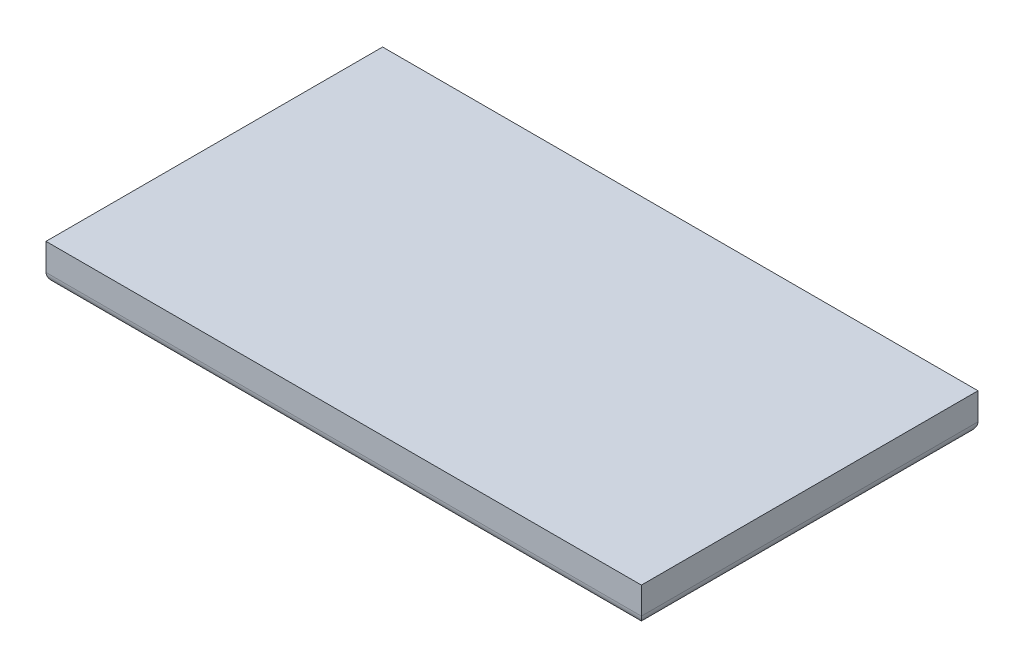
ISO-10303-21;
HEADER;
FILE_DESCRIPTION(('STEP AP214'),'2;1');
FILE_NAME('part.step','',(''),(''),'','','');
FILE_SCHEMA(('AUTOMOTIVE_DESIGN { 1 0 10303 214 1 1 1 1 }'));
ENDSEC;
DATA;
#1=APPLICATION_CONTEXT('core data for automotive mechanical design processes');
#2=APPLICATION_PROTOCOL_DEFINITION('international standard','automotive_design',2000,#1);
#3=PRODUCT_CONTEXT('',#1,'mechanical');
#4=PRODUCT('Part','Part','',(#3));
#5=PRODUCT_RELATED_PRODUCT_CATEGORY('part','',(#4));
#6=PRODUCT_DEFINITION_FORMATION('','',#4);
#7=PRODUCT_DEFINITION_CONTEXT('part definition',#1,'design');
#8=PRODUCT_DEFINITION('design','',#6,#7);
#9=PRODUCT_DEFINITION_SHAPE('','',#8);
#10=(LENGTH_UNIT() NAMED_UNIT(*) SI_UNIT(.MILLI.,.METRE.));
#11=(NAMED_UNIT(*) PLANE_ANGLE_UNIT() SI_UNIT($,.RADIAN.));
#12=(NAMED_UNIT(*) SI_UNIT($,.STERADIAN.) SOLID_ANGLE_UNIT());
#13=UNCERTAINTY_MEASURE_WITH_UNIT(LENGTH_MEASURE(1.E-05),#10,'distance_accuracy_value','');
#14=(GEOMETRIC_REPRESENTATION_CONTEXT(3) GLOBAL_UNCERTAINTY_ASSIGNED_CONTEXT((#13)) GLOBAL_UNIT_ASSIGNED_CONTEXT((#10,
#11,#12)) REPRESENTATION_CONTEXT('',''));
#15=CARTESIAN_POINT('',(0.,0.,0.));
#16=DIRECTION('',(0.,0.,1.));
#17=DIRECTION('',(1.,0.,0.));
#18=AXIS2_PLACEMENT_3D('',#15,#16,#17);
#19=CARTESIAN_POINT('',(8.844,1.1,-5.));
#20=DIRECTION('',(-1.,0.,0.));
#21=DIRECTION('',(0.,0.,1.));
#22=AXIS2_PLACEMENT_3D('',#19,#20,#21);
#23=PLANE('',#22);
#24=DIRECTION('',(0.,-1.,0.));
#25=VECTOR('',#24,1.);
#26=CARTESIAN_POINT('',(8.844,1.1,5.));
#27=LINE('',#26,#25);
#28=CARTESIAN_POINT('',(8.844,1.1,5.));
#29=VERTEX_POINT('',#28);
#30=CARTESIAN_POINT('',(8.844,0.3,5.));
#31=VERTEX_POINT('',#30);
#32=EDGE_CURVE('E153',#29,#31,#27,.T.);
#33=ORIENTED_EDGE('',*,*,#32,.T.);
#34=DIRECTION('',(0.,0.,-1.));
#35=VECTOR('',#34,1.);
#36=CARTESIAN_POINT('',(8.844,0.3,-5.));
#37=LINE('',#36,#35);
#38=CARTESIAN_POINT('',(8.844,0.3,-5.));
#39=VERTEX_POINT('',#38);
#40=EDGE_CURVE('E11',#31,#39,#37,.T.);
#41=ORIENTED_EDGE('',*,*,#40,.T.);
#42=DIRECTION('',(0.,-1.,0.));
#43=VECTOR('',#42,1.);
#44=CARTESIAN_POINT('',(8.844,1.1,-5.));
#45=LINE('',#44,#43);
#46=CARTESIAN_POINT('',(8.844,1.1,-5.));
#47=VERTEX_POINT('',#46);
#48=EDGE_CURVE('E95',#47,#39,#45,.T.);
#49=ORIENTED_EDGE('',*,*,#48,.F.);
#50=DIRECTION('',(0.,0.,-1.));
#51=VECTOR('',#50,1.);
#52=CARTESIAN_POINT('',(8.844,1.1,-5.));
#53=LINE('',#52,#51);
#54=EDGE_CURVE('E101',#29,#47,#53,.T.);
#55=ORIENTED_EDGE('',*,*,#54,.F.);
#56=EDGE_LOOP('',(#33,#41,#49,#55));
#57=FACE_BOUND('',#56,.T.);
#58=ADVANCED_FACE('F34',(#57),#23,.F.);
#59=CARTESIAN_POINT('',(-8.844,1.1,-5.));
#60=DIRECTION('',(0.,0.,1.));
#61=DIRECTION('',(1.,0.,0.));
#62=AXIS2_PLACEMENT_3D('',#59,#60,#61);
#63=PLANE('',#62);
#64=ORIENTED_EDGE('',*,*,#48,.T.);
#65=DIRECTION('',(-1.,0.,0.));
#66=VECTOR('',#65,1.);
#67=CARTESIAN_POINT('',(-8.844,0.3,-5.));
#68=LINE('',#67,#66);
#69=CARTESIAN_POINT('',(-8.844,0.3,-5.));
#70=VERTEX_POINT('',#69);
#71=EDGE_CURVE('E110',#39,#70,#68,.T.);
#72=ORIENTED_EDGE('',*,*,#71,.T.);
#73=DIRECTION('',(0.,-1.,0.));
#74=VECTOR('',#73,1.);
#75=CARTESIAN_POINT('',(-8.844,1.1,-5.));
#76=LINE('',#75,#74);
#77=CARTESIAN_POINT('',(-8.844,1.1,-5.));
#78=VERTEX_POINT('',#77);
#79=EDGE_CURVE('E97',#78,#70,#76,.T.);
#80=ORIENTED_EDGE('',*,*,#79,.F.);
#81=DIRECTION('',(-1.,0.,0.));
#82=VECTOR('',#81,1.);
#83=CARTESIAN_POINT('',(-8.844,1.1,-5.));
#84=LINE('',#83,#82);
#85=EDGE_CURVE('E90',#47,#78,#84,.T.);
#86=ORIENTED_EDGE('',*,*,#85,.F.);
#87=EDGE_LOOP('',(#64,#72,#80,#86));
#88=FACE_BOUND('',#87,.T.);
#89=ADVANCED_FACE('F92',(#88),#63,.F.);
#90=CARTESIAN_POINT('',(-8.844,1.1,-5.));
#91=DIRECTION('',(1.,0.,0.));
#92=DIRECTION('',(0.,0.,-1.));
#93=AXIS2_PLACEMENT_3D('',#90,#91,#92);
#94=PLANE('',#93);
#95=ORIENTED_EDGE('',*,*,#79,.T.);
#96=DIRECTION('',(0.,0.,1.));
#97=VECTOR('',#96,1.);
#98=CARTESIAN_POINT('',(-8.844,0.3,-5.));
#99=LINE('',#98,#97);
#100=CARTESIAN_POINT('',(-8.84399999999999,0.3,5.));
#101=VERTEX_POINT('',#100);
#102=EDGE_CURVE('E58',#70,#101,#99,.T.);
#103=ORIENTED_EDGE('',*,*,#102,.T.);
#104=DIRECTION('',(0.,-1.,0.));
#105=VECTOR('',#104,1.);
#106=CARTESIAN_POINT('',(-8.84399999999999,1.1,5.));
#107=LINE('',#106,#105);
#108=CARTESIAN_POINT('',(-8.84399999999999,1.1,5.));
#109=VERTEX_POINT('',#108);
#110=EDGE_CURVE('E114',#109,#101,#107,.T.);
#111=ORIENTED_EDGE('',*,*,#110,.F.);
#112=DIRECTION('',(0.,0.,1.));
#113=VECTOR('',#112,1.);
#114=CARTESIAN_POINT('',(-8.844,1.1,-5.));
#115=LINE('',#114,#113);
#116=EDGE_CURVE('E100',#78,#109,#115,.T.);
#117=ORIENTED_EDGE('',*,*,#116,.F.);
#118=EDGE_LOOP('',(#95,#103,#111,#117));
#119=FACE_BOUND('',#118,.T.);
#120=ADVANCED_FACE('F151',(#119),#94,.F.);
#121=CARTESIAN_POINT('',(-8.84399999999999,1.1,5.));
#122=DIRECTION('',(0.,0.,-1.));
#123=DIRECTION('',(-1.,0.,0.));
#124=AXIS2_PLACEMENT_3D('',#121,#122,#123);
#125=PLANE('',#124);
#126=ORIENTED_EDGE('',*,*,#110,.T.);
#127=DIRECTION('',(1.,0.,0.));
#128=VECTOR('',#127,1.);
#129=CARTESIAN_POINT('',(-8.84399999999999,0.3,5.));
#130=LINE('',#129,#128);
#131=EDGE_CURVE('E43',#101,#31,#130,.T.);
#132=ORIENTED_EDGE('',*,*,#131,.T.);
#133=ORIENTED_EDGE('',*,*,#32,.F.);
#134=DIRECTION('',(1.,0.,0.));
#135=VECTOR('',#134,1.);
#136=CARTESIAN_POINT('',(-8.84399999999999,1.1,5.));
#137=LINE('',#136,#135);
#138=EDGE_CURVE('E106',#109,#29,#137,.T.);
#139=ORIENTED_EDGE('',*,*,#138,.F.);
#140=EDGE_LOOP('',(#126,#132,#133,#139));
#141=FACE_BOUND('',#140,.T.);
#142=ADVANCED_FACE('F156',(#141),#125,.F.);
#143=CARTESIAN_POINT('',(0.,1.1,0.));
#144=DIRECTION('',(0.,1.,0.));
#145=DIRECTION('',(0.,0.,1.));
#146=AXIS2_PLACEMENT_3D('',#143,#144,#145);
#147=PLANE('',#146);
#148=ORIENTED_EDGE('',*,*,#54,.T.);
#149=ORIENTED_EDGE('',*,*,#85,.T.);
#150=ORIENTED_EDGE('',*,*,#116,.T.);
#151=ORIENTED_EDGE('',*,*,#138,.T.);
#152=EDGE_LOOP('',(#148,#149,#150,#151));
#153=FACE_BOUND('',#152,.T.);
#154=ADVANCED_FACE('F104',(#153),#147,.T.);
#155=CARTESIAN_POINT('',(0.,0.,0.));
#156=DIRECTION('',(0.,1.,0.));
#157=DIRECTION('',(0.,0.,1.));
#158=AXIS2_PLACEMENT_3D('',#155,#156,#157);
#159=PLANE('',#158);
#160=DIRECTION('',(0.,0.,1.));
#161=VECTOR('',#160,1.);
#162=CARTESIAN_POINT('',(-8.544,0.,0.));
#163=LINE('',#162,#161);
#164=CARTESIAN_POINT('',(-8.544,0.,4.7));
#165=VERTEX_POINT('',#164);
#166=CARTESIAN_POINT('',(-8.544,0.,-4.7));
#167=VERTEX_POINT('',#166);
#168=EDGE_CURVE('E121',#165,#167,#163,.F.);
#169=ORIENTED_EDGE('',*,*,#168,.T.);
#170=DIRECTION('',(-1.,0.,0.));
#171=VECTOR('',#170,1.);
#172=CARTESIAN_POINT('',(0.,0.,-4.7));
#173=LINE('',#172,#171);
#174=CARTESIAN_POINT('',(8.544,0.,-4.7));
#175=VERTEX_POINT('',#174);
#176=EDGE_CURVE('E123',#167,#175,#173,.F.);
#177=ORIENTED_EDGE('',*,*,#176,.T.);
#178=DIRECTION('',(0.,0.,-1.));
#179=VECTOR('',#178,1.);
#180=CARTESIAN_POINT('',(8.544,0.,0.));
#181=LINE('',#180,#179);
#182=CARTESIAN_POINT('',(8.544,0.,4.7));
#183=VERTEX_POINT('',#182);
#184=EDGE_CURVE('E112',#175,#183,#181,.F.);
#185=ORIENTED_EDGE('',*,*,#184,.T.);
#186=DIRECTION('',(1.,0.,0.));
#187=VECTOR('',#186,1.);
#188=CARTESIAN_POINT('',(0.,0.,4.7));
#189=LINE('',#188,#187);
#190=EDGE_CURVE('E119',#183,#165,#189,.F.);
#191=ORIENTED_EDGE('',*,*,#190,.T.);
#192=EDGE_LOOP('',(#169,#177,#185,#191));
#193=FACE_BOUND('',#192,.T.);
#194=ADVANCED_FACE('F144',(#193),#159,.F.);
#195=CARTESIAN_POINT('',(-8.84399999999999,0.3,4.7));
#196=DIRECTION('',(1.,0.,0.));
#197=DIRECTION('',(0.,0.,-1.));
#198=AXIS2_PLACEMENT_3D('',#195,#196,#197);
#199=CYLINDRICAL_SURFACE('',#198,0.3);
#200=CARTESIAN_POINT('',(-8.544,0.3,4.7));
#201=DIRECTION('',(0.707106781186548,0.,0.707106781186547));
#202=DIRECTION('',(0.707106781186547,0.,-0.707106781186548));
#203=AXIS2_PLACEMENT_3D('',#200,#201,#202);
#204=ELLIPSE('',#203,0.424264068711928,0.3);
#205=EDGE_CURVE('E131',#165,#101,#204,.F.);
#206=ORIENTED_EDGE('',*,*,#205,.F.);
#207=ORIENTED_EDGE('',*,*,#190,.F.);
#208=CARTESIAN_POINT('',(8.544,0.3,4.7));
#209=DIRECTION('',(0.707106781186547,0.,-0.707106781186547));
#210=DIRECTION('',(-0.707106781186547,0.,-0.707106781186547));
#211=AXIS2_PLACEMENT_3D('',#208,#209,#210);
#212=ELLIPSE('',#211,0.424264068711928,0.3);
#213=EDGE_CURVE('E38',#31,#183,#212,.T.);
#214=ORIENTED_EDGE('',*,*,#213,.F.);
#215=ORIENTED_EDGE('',*,*,#131,.F.);
#216=EDGE_LOOP('',(#206,#207,#214,#215));
#217=FACE_BOUND('',#216,.T.);
#218=ADVANCED_FACE('F36',(#217),#199,.T.);
#219=CARTESIAN_POINT('',(8.544,0.3,-5.));
#220=DIRECTION('',(0.,0.,-1.));
#221=DIRECTION('',(-1.,0.,0.));
#222=AXIS2_PLACEMENT_3D('',#219,#220,#221);
#223=CYLINDRICAL_SURFACE('',#222,0.3);
#224=ORIENTED_EDGE('',*,*,#213,.T.);
#225=ORIENTED_EDGE('',*,*,#184,.F.);
#226=CARTESIAN_POINT('',(8.544,0.3,-4.7));
#227=DIRECTION('',(-0.707106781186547,0.,-0.707106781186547));
#228=DIRECTION('',(0.707106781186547,0.,-0.707106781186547));
#229=AXIS2_PLACEMENT_3D('',#226,#227,#228);
#230=ELLIPSE('',#229,0.424264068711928,0.3);
#231=EDGE_CURVE('E130',#39,#175,#230,.T.);
#232=ORIENTED_EDGE('',*,*,#231,.F.);
#233=ORIENTED_EDGE('',*,*,#40,.F.);
#234=EDGE_LOOP('',(#224,#225,#232,#233));
#235=FACE_BOUND('',#234,.T.);
#236=ADVANCED_FACE('F140',(#235),#223,.T.);
#237=CARTESIAN_POINT('',(-8.544,0.3,-5.));
#238=DIRECTION('',(0.,0.,1.));
#239=DIRECTION('',(1.,0.,0.));
#240=AXIS2_PLACEMENT_3D('',#237,#238,#239);
#241=CYLINDRICAL_SURFACE('',#240,0.3);
#242=ORIENTED_EDGE('',*,*,#205,.T.);
#243=ORIENTED_EDGE('',*,*,#102,.F.);
#244=CARTESIAN_POINT('',(-8.544,0.3,-4.7));
#245=DIRECTION('',(-0.707106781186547,0.,0.707106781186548));
#246=DIRECTION('',(0.707106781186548,0.,0.707106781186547));
#247=AXIS2_PLACEMENT_3D('',#244,#245,#246);
#248=ELLIPSE('',#247,0.424264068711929,0.3);
#249=EDGE_CURVE('E128',#167,#70,#248,.F.);
#250=ORIENTED_EDGE('',*,*,#249,.F.);
#251=ORIENTED_EDGE('',*,*,#168,.F.);
#252=EDGE_LOOP('',(#242,#243,#250,#251));
#253=FACE_BOUND('',#252,.T.);
#254=ADVANCED_FACE('F150',(#253),#241,.T.);
#255=CARTESIAN_POINT('',(-8.844,0.3,-4.7));
#256=DIRECTION('',(-1.,0.,0.));
#257=DIRECTION('',(0.,0.,1.));
#258=AXIS2_PLACEMENT_3D('',#255,#256,#257);
#259=CYLINDRICAL_SURFACE('',#258,0.3);
#260=ORIENTED_EDGE('',*,*,#231,.T.);
#261=ORIENTED_EDGE('',*,*,#176,.F.);
#262=ORIENTED_EDGE('',*,*,#249,.T.);
#263=ORIENTED_EDGE('',*,*,#71,.F.);
#264=EDGE_LOOP('',(#260,#261,#262,#263));
#265=FACE_BOUND('',#264,.T.);
#266=ADVANCED_FACE('F148',(#265),#259,.T.);
#267=CLOSED_SHELL('',(#58,#89,#120,#142,#154,#194,#218,#236,#254,#266));
#268=MANIFOLD_SOLID_BREP('B2',#267);
#269=ADVANCED_BREP_SHAPE_REPRESENTATION('',(#18,#268),#14);
#270=SHAPE_DEFINITION_REPRESENTATION(#9,#269);
ENDSEC;
END-ISO-10303-21;
